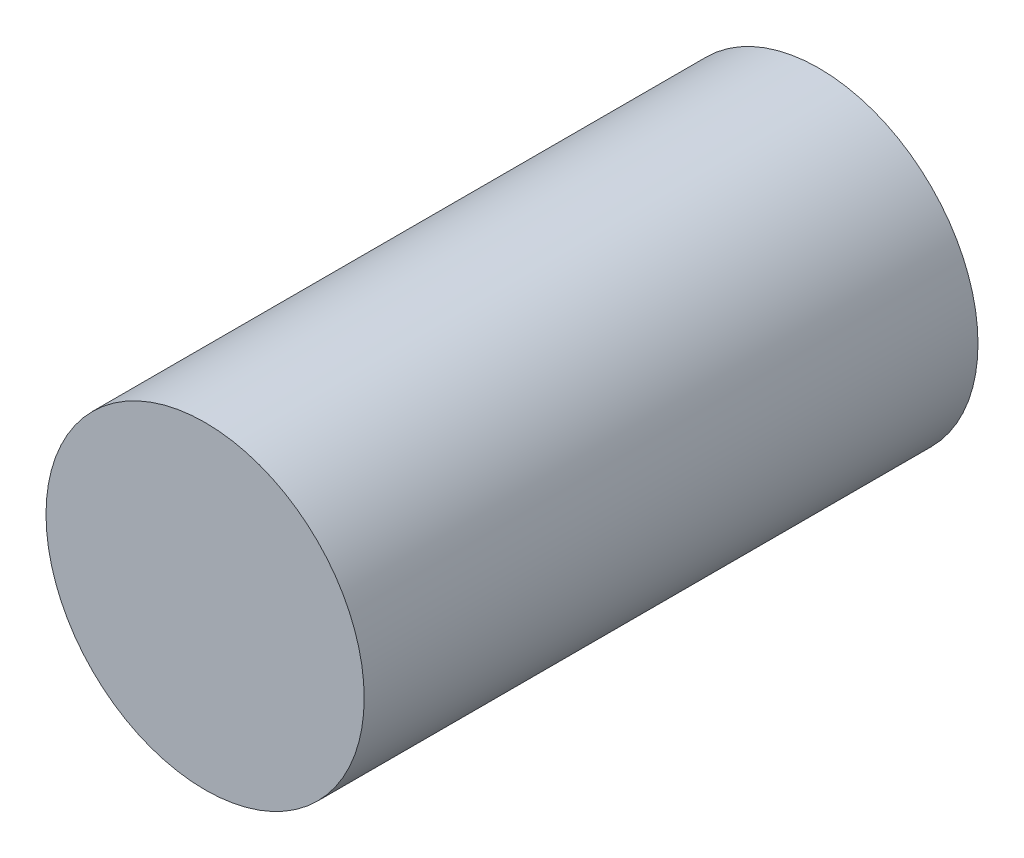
ISO-10303-21;
HEADER;
FILE_DESCRIPTION(('STEP AP214'),'2;1');
FILE_NAME('part.step','',(''),(''),'','','');
FILE_SCHEMA(('AUTOMOTIVE_DESIGN { 1 0 10303 214 1 1 1 1 }'));
ENDSEC;
DATA;
#1=APPLICATION_CONTEXT('core data for automotive mechanical design processes');
#2=APPLICATION_PROTOCOL_DEFINITION('international standard','automotive_design',2000,#1);
#3=PRODUCT_CONTEXT('',#1,'mechanical');
#4=PRODUCT('Part','Part','',(#3));
#5=PRODUCT_RELATED_PRODUCT_CATEGORY('part','',(#4));
#6=PRODUCT_DEFINITION_FORMATION('','',#4);
#7=PRODUCT_DEFINITION_CONTEXT('part definition',#1,'design');
#8=PRODUCT_DEFINITION('design','',#6,#7);
#9=PRODUCT_DEFINITION_SHAPE('','',#8);
#10=(LENGTH_UNIT() NAMED_UNIT(*) SI_UNIT(.MILLI.,.METRE.));
#11=(NAMED_UNIT(*) PLANE_ANGLE_UNIT() SI_UNIT($,.RADIAN.));
#12=(NAMED_UNIT(*) SI_UNIT($,.STERADIAN.) SOLID_ANGLE_UNIT());
#13=UNCERTAINTY_MEASURE_WITH_UNIT(LENGTH_MEASURE(1.E-05),#10,'distance_accuracy_value','');
#14=(GEOMETRIC_REPRESENTATION_CONTEXT(3) GLOBAL_UNCERTAINTY_ASSIGNED_CONTEXT((#13)) GLOBAL_UNIT_ASSIGNED_CONTEXT((#10,
#11,#12)) REPRESENTATION_CONTEXT('',''));
#15=CARTESIAN_POINT('',(0.,0.,0.));
#16=DIRECTION('',(0.,0.,1.));
#17=DIRECTION('',(1.,0.,0.));
#18=AXIS2_PLACEMENT_3D('',#15,#16,#17);
#19=CARTESIAN_POINT('',(-50.,50.,19.29));
#20=DIRECTION('',(0.,0.,-1.));
#21=DIRECTION('',(-1.,0.,0.));
#22=AXIS2_PLACEMENT_3D('',#19,#20,#21);
#23=CYLINDRICAL_SURFACE('',#22,5.00000000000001);
#24=CARTESIAN_POINT('',(-50.,50.,19.29));
#25=DIRECTION('',(0.,0.,1.));
#26=DIRECTION('',(1.,0.,0.));
#27=AXIS2_PLACEMENT_3D('',#24,#25,#26);
#28=CIRCLE('',#27,5.00000000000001);
#29=CARTESIAN_POINT('',(-45.,50.,19.29));
#30=VERTEX_POINT('',#29);
#31=EDGE_CURVE('E10',#30,#30,#28,.T.);
#32=ORIENTED_EDGE('',*,*,#31,.F.);
#33=EDGE_LOOP('',(#32));
#34=FACE_BOUND('',#33,.T.);
#35=CARTESIAN_POINT('',(-50.,50.,0.));
#36=DIRECTION('',(0.,0.,1.));
#37=DIRECTION('',(1.,0.,0.));
#38=AXIS2_PLACEMENT_3D('',#35,#36,#37);
#39=CIRCLE('',#38,5.00000000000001);
#40=CARTESIAN_POINT('',(-45.,50.,0.));
#41=VERTEX_POINT('',#40);
#42=EDGE_CURVE('E32',#41,#41,#39,.T.);
#43=ORIENTED_EDGE('',*,*,#42,.T.);
#44=EDGE_LOOP('',(#43));
#45=FACE_BOUND('',#44,.T.);
#46=ADVANCED_FACE('F26',(#34,#45),#23,.T.);
#47=CARTESIAN_POINT('',(-50.,50.,19.29));
#48=DIRECTION('',(0.,0.,1.));
#49=DIRECTION('',(1.,0.,0.));
#50=AXIS2_PLACEMENT_3D('',#47,#48,#49);
#51=PLANE('',#50);
#52=ORIENTED_EDGE('',*,*,#31,.T.);
#53=EDGE_LOOP('',(#52));
#54=FACE_BOUND('',#53,.T.);
#55=ADVANCED_FACE('F41',(#54),#51,.T.);
#56=CARTESIAN_POINT('',(-50.,50.,0.));
#57=DIRECTION('',(0.,0.,1.));
#58=DIRECTION('',(1.,0.,0.));
#59=AXIS2_PLACEMENT_3D('',#56,#57,#58);
#60=PLANE('',#59);
#61=ORIENTED_EDGE('',*,*,#42,.F.);
#62=EDGE_LOOP('',(#61));
#63=FACE_BOUND('',#62,.T.);
#64=ADVANCED_FACE('F39',(#63),#60,.F.);
#65=CLOSED_SHELL('',(#46,#55,#64));
#66=MANIFOLD_SOLID_BREP('B2',#65);
#67=ADVANCED_BREP_SHAPE_REPRESENTATION('',(#18,#66),#14);
#68=SHAPE_DEFINITION_REPRESENTATION(#9,#67);
ENDSEC;
END-ISO-10303-21;
